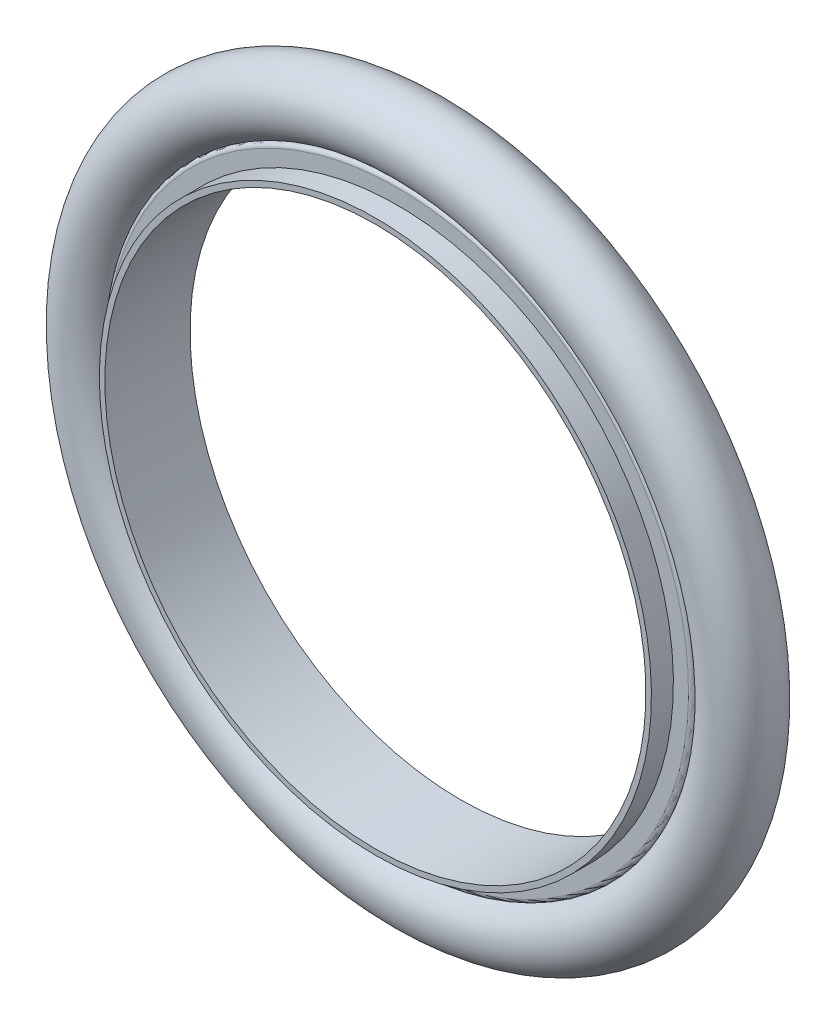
ISO-10303-21;
HEADER;
FILE_DESCRIPTION(('STEP AP214'),'2;1');
FILE_NAME('part.step','',(''),(''),'','','');
FILE_SCHEMA(('AUTOMOTIVE_DESIGN { 1 0 10303 214 1 1 1 1 }'));
ENDSEC;
DATA;
#1=APPLICATION_CONTEXT('core data for automotive mechanical design processes');
#2=APPLICATION_PROTOCOL_DEFINITION('international standard','automotive_design',2000,#1);
#3=PRODUCT_CONTEXT('',#1,'mechanical');
#4=PRODUCT('Part','Part','',(#3));
#5=PRODUCT_RELATED_PRODUCT_CATEGORY('part','',(#4));
#6=PRODUCT_DEFINITION_FORMATION('','',#4);
#7=PRODUCT_DEFINITION_CONTEXT('part definition',#1,'design');
#8=PRODUCT_DEFINITION('design','',#6,#7);
#9=PRODUCT_DEFINITION_SHAPE('','',#8);
#10=(LENGTH_UNIT() NAMED_UNIT(*) SI_UNIT(.MILLI.,.METRE.));
#11=(NAMED_UNIT(*) PLANE_ANGLE_UNIT() SI_UNIT($,.RADIAN.));
#12=(NAMED_UNIT(*) SI_UNIT($,.STERADIAN.) SOLID_ANGLE_UNIT());
#13=UNCERTAINTY_MEASURE_WITH_UNIT(LENGTH_MEASURE(1.E-05),#10,'distance_accuracy_value','');
#14=(GEOMETRIC_REPRESENTATION_CONTEXT(3) GLOBAL_UNCERTAINTY_ASSIGNED_CONTEXT((#13)) GLOBAL_UNIT_ASSIGNED_CONTEXT((#10,
#11,#12)) REPRESENTATION_CONTEXT('',''));
#15=CARTESIAN_POINT('',(0.,0.,0.));
#16=DIRECTION('',(0.,0.,1.));
#17=DIRECTION('',(1.,0.,0.));
#18=AXIS2_PLACEMENT_3D('',#15,#16,#17);
#19=CARTESIAN_POINT('',(0.,0.,0.));
#20=DIRECTION('',(0.,0.,1.));
#21=DIRECTION('',(0.,-1.,0.));
#22=AXIS2_PLACEMENT_3D('',#19,#20,#21);
#23=TOROIDAL_SURFACE('',#22,29.9873736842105,3.09612631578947);
#24=CARTESIAN_POINT('',(0.,-33.0835,0.));
#25=VERTEX_POINT('',#24);
#26=VERTEX_LOOP('',#25);
#27=FACE_BOUND('',#26,.T.);
#28=ADVANCED_FACE('F36',(#27),#23,.T.);
#29=CLOSED_SHELL('',(#28));
#30=MANIFOLD_SOLID_BREP('B2',#29);
#31=CARTESIAN_POINT('',(0.,0.,0.));
#32=DIRECTION('',(0.,0.,1.));
#33=DIRECTION('',(0.,-1.,0.));
#34=AXIS2_PLACEMENT_3D('',#31,#32,#33);
#35=TOROIDAL_SURFACE('',#34,29.9873736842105,3.09612631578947);
#36=CARTESIAN_POINT('',(0.,0.,1.52399999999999));
#37=DIRECTION('',(0.,0.,1.));
#38=DIRECTION('',(0.,-1.,0.));
#39=AXIS2_PLACEMENT_3D('',#36,#37,#38);
#40=CIRCLE('',#39,27.2923);
#41=CARTESIAN_POINT('',(0.,-27.2923,1.52399999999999));
#42=VERTEX_POINT('',#41);
#43=EDGE_CURVE('E35',#42,#42,#40,.T.);
#44=ORIENTED_EDGE('',*,*,#43,.F.);
#45=EDGE_LOOP('',(#44));
#46=FACE_BOUND('',#45,.T.);
#47=CARTESIAN_POINT('',(0.,0.,-1.524));
#48=DIRECTION('',(0.,0.,1.));
#49=DIRECTION('',(0.,-1.,0.));
#50=AXIS2_PLACEMENT_3D('',#47,#48,#49);
#51=CIRCLE('',#50,27.2923);
#52=CARTESIAN_POINT('',(0.,-27.2923,-1.52400000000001));
#53=VERTEX_POINT('',#52);
#54=EDGE_CURVE('E82',#53,#53,#51,.T.);
#55=ORIENTED_EDGE('',*,*,#54,.T.);
#56=EDGE_LOOP('',(#55));
#57=FACE_BOUND('',#56,.T.);
#58=ADVANCED_FACE('F48',(#46,#57),#35,.F.);
#59=CARTESIAN_POINT('',(0.,0.,1.52399999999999));
#60=DIRECTION('',(0.,0.,1.));
#61=DIRECTION('',(0.,-1.,0.));
#62=AXIS2_PLACEMENT_3D('',#59,#60,#61);
#63=TOROIDAL_SURFACE('',#62,26.9113,0.381000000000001);
#64=CARTESIAN_POINT('',(0.,0.,1.905));
#65=DIRECTION('',(0.,0.,1.));
#66=DIRECTION('',(0.,-1.,0.));
#67=AXIS2_PLACEMENT_3D('',#64,#65,#66);
#68=CIRCLE('',#67,26.9113);
#69=CARTESIAN_POINT('',(0.,-26.9113,1.90499999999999));
#70=VERTEX_POINT('',#69);
#71=EDGE_CURVE('E54',#70,#70,#68,.T.);
#72=ORIENTED_EDGE('',*,*,#71,.F.);
#73=EDGE_LOOP('',(#72));
#74=FACE_BOUND('',#73,.T.);
#75=ORIENTED_EDGE('',*,*,#43,.T.);
#76=EDGE_LOOP('',(#75));
#77=FACE_BOUND('',#76,.T.);
#78=ADVANCED_FACE('F131',(#74,#77),#63,.T.);
#79=CARTESIAN_POINT('',(0.,25.5143,1.905));
#80=DIRECTION('',(0.,0.,-1.));
#81=DIRECTION('',(0.,1.,0.));
#82=AXIS2_PLACEMENT_3D('',#79,#80,#81);
#83=PLANE('',#82);
#84=CARTESIAN_POINT('',(0.,0.,1.90499999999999));
#85=DIRECTION('',(0.,0.,1.));
#86=DIRECTION('',(0.,-1.,0.));
#87=AXIS2_PLACEMENT_3D('',#84,#85,#86);
#88=CIRCLE('',#87,25.5143);
#89=CARTESIAN_POINT('',(0.,-25.5143,1.90499999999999));
#90=VERTEX_POINT('',#89);
#91=EDGE_CURVE('E58',#90,#90,#88,.T.);
#92=ORIENTED_EDGE('',*,*,#91,.F.);
#93=EDGE_LOOP('',(#92));
#94=FACE_BOUND('',#93,.T.);
#95=ORIENTED_EDGE('',*,*,#71,.T.);
#96=EDGE_LOOP('',(#95));
#97=FACE_BOUND('',#96,.T.);
#98=ADVANCED_FACE('F126',(#94,#97),#83,.F.);
#99=CARTESIAN_POINT('',(0.,0.,3.937));
#100=DIRECTION('',(0.,0.,1.));
#101=DIRECTION('',(0.,-1.,0.));
#102=AXIS2_PLACEMENT_3D('',#99,#100,#101);
#103=CYLINDRICAL_SURFACE('',#102,25.5143);
#104=CARTESIAN_POINT('',(0.,0.,3.937));
#105=DIRECTION('',(0.,0.,1.));
#106=DIRECTION('',(0.,-1.,0.));
#107=AXIS2_PLACEMENT_3D('',#104,#105,#106);
#108=CIRCLE('',#107,25.5143);
#109=CARTESIAN_POINT('',(0.,-25.5143,3.937));
#110=VERTEX_POINT('',#109);
#111=EDGE_CURVE('E62',#110,#110,#108,.T.);
#112=ORIENTED_EDGE('',*,*,#111,.F.);
#113=EDGE_LOOP('',(#112));
#114=FACE_BOUND('',#113,.T.);
#115=ORIENTED_EDGE('',*,*,#91,.T.);
#116=EDGE_LOOP('',(#115));
#117=FACE_BOUND('',#116,.T.);
#118=ADVANCED_FACE('F120',(#114,#117),#103,.T.);
#119=CARTESIAN_POINT('',(0.,25.0063,3.93700000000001));
#120=DIRECTION('',(0.,0.,-1.));
#121=DIRECTION('',(0.,1.,0.));
#122=AXIS2_PLACEMENT_3D('',#119,#120,#121);
#123=PLANE('',#122);
#124=CARTESIAN_POINT('',(0.,0.,3.93700000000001));
#125=DIRECTION('',(0.,0.,1.));
#126=DIRECTION('',(0.,-1.,0.));
#127=AXIS2_PLACEMENT_3D('',#124,#125,#126);
#128=CIRCLE('',#127,25.0063);
#129=CARTESIAN_POINT('',(0.,-25.0063,3.937));
#130=VERTEX_POINT('',#129);
#131=EDGE_CURVE('E67',#130,#130,#128,.T.);
#132=ORIENTED_EDGE('',*,*,#131,.F.);
#133=EDGE_LOOP('',(#132));
#134=FACE_BOUND('',#133,.T.);
#135=ORIENTED_EDGE('',*,*,#111,.T.);
#136=EDGE_LOOP('',(#135));
#137=FACE_BOUND('',#136,.T.);
#138=ADVANCED_FACE('F114',(#134,#137),#123,.F.);
#139=CARTESIAN_POINT('',(0.,0.,3.937));
#140=DIRECTION('',(0.,0.,1.));
#141=DIRECTION('',(0.,-1.,0.));
#142=AXIS2_PLACEMENT_3D('',#139,#140,#141);
#143=CYLINDRICAL_SURFACE('',#142,25.0063);
#144=CARTESIAN_POINT('',(0.,0.,-3.93699999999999));
#145=DIRECTION('',(0.,0.,1.));
#146=DIRECTION('',(0.,-1.,0.));
#147=AXIS2_PLACEMENT_3D('',#144,#145,#146);
#148=CIRCLE('',#147,25.0063);
#149=CARTESIAN_POINT('',(0.,-25.0063,-3.937));
#150=VERTEX_POINT('',#149);
#151=EDGE_CURVE('E70',#150,#150,#148,.T.);
#152=ORIENTED_EDGE('',*,*,#151,.F.);
#153=EDGE_LOOP('',(#152));
#154=FACE_BOUND('',#153,.T.);
#155=ORIENTED_EDGE('',*,*,#131,.T.);
#156=EDGE_LOOP('',(#155));
#157=FACE_BOUND('',#156,.T.);
#158=ADVANCED_FACE('F108',(#154,#157),#143,.F.);
#159=CARTESIAN_POINT('',(0.,25.0063,-3.937));
#160=DIRECTION('',(0.,0.,1.));
#161=DIRECTION('',(0.,-1.,0.));
#162=AXIS2_PLACEMENT_3D('',#159,#160,#161);
#163=PLANE('',#162);
#164=CARTESIAN_POINT('',(0.,0.,-3.93700000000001));
#165=DIRECTION('',(0.,0.,1.));
#166=DIRECTION('',(0.,-1.,0.));
#167=AXIS2_PLACEMENT_3D('',#164,#165,#166);
#168=CIRCLE('',#167,25.5143);
#169=CARTESIAN_POINT('',(0.,-25.5143,-3.93700000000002));
#170=VERTEX_POINT('',#169);
#171=EDGE_CURVE('E73',#170,#170,#168,.T.);
#172=ORIENTED_EDGE('',*,*,#171,.F.);
#173=EDGE_LOOP('',(#172));
#174=FACE_BOUND('',#173,.T.);
#175=ORIENTED_EDGE('',*,*,#151,.T.);
#176=EDGE_LOOP('',(#175));
#177=FACE_BOUND('',#176,.T.);
#178=ADVANCED_FACE('F102',(#174,#177),#163,.F.);
#179=CARTESIAN_POINT('',(0.,0.,3.937));
#180=DIRECTION('',(0.,0.,1.));
#181=DIRECTION('',(0.,-1.,0.));
#182=AXIS2_PLACEMENT_3D('',#179,#180,#181);
#183=CYLINDRICAL_SURFACE('',#182,25.5143);
#184=CARTESIAN_POINT('',(0.,0.,-1.905));
#185=DIRECTION('',(0.,0.,1.));
#186=DIRECTION('',(0.,-1.,0.));
#187=AXIS2_PLACEMENT_3D('',#184,#185,#186);
#188=CIRCLE('',#187,25.5143);
#189=CARTESIAN_POINT('',(0.,-25.5143,-1.90500000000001));
#190=VERTEX_POINT('',#189);
#191=EDGE_CURVE('E76',#190,#190,#188,.T.);
#192=ORIENTED_EDGE('',*,*,#191,.F.);
#193=EDGE_LOOP('',(#192));
#194=FACE_BOUND('',#193,.T.);
#195=ORIENTED_EDGE('',*,*,#171,.T.);
#196=EDGE_LOOP('',(#195));
#197=FACE_BOUND('',#196,.T.);
#198=ADVANCED_FACE('F96',(#194,#197),#183,.T.);
#199=CARTESIAN_POINT('',(0.,25.5143,-1.905));
#200=DIRECTION('',(0.,0.,1.));
#201=DIRECTION('',(0.,-1.,0.));
#202=AXIS2_PLACEMENT_3D('',#199,#200,#201);
#203=PLANE('',#202);
#204=CARTESIAN_POINT('',(0.,0.,-1.905));
#205=DIRECTION('',(0.,0.,1.));
#206=DIRECTION('',(0.,-1.,0.));
#207=AXIS2_PLACEMENT_3D('',#204,#205,#206);
#208=CIRCLE('',#207,26.9113);
#209=CARTESIAN_POINT('',(0.,-26.9113,-1.90500000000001));
#210=VERTEX_POINT('',#209);
#211=EDGE_CURVE('E79',#210,#210,#208,.T.);
#212=ORIENTED_EDGE('',*,*,#211,.F.);
#213=EDGE_LOOP('',(#212));
#214=FACE_BOUND('',#213,.T.);
#215=ORIENTED_EDGE('',*,*,#191,.T.);
#216=EDGE_LOOP('',(#215));
#217=FACE_BOUND('',#216,.T.);
#218=ADVANCED_FACE('F90',(#214,#217),#203,.F.);
#219=CARTESIAN_POINT('',(0.,0.,-1.524));
#220=DIRECTION('',(0.,0.,1.));
#221=DIRECTION('',(0.,-1.,0.));
#222=AXIS2_PLACEMENT_3D('',#219,#220,#221);
#223=TOROIDAL_SURFACE('',#222,26.9113,0.381000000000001);
#224=ORIENTED_EDGE('',*,*,#54,.F.);
#225=EDGE_LOOP('',(#224));
#226=FACE_BOUND('',#225,.T.);
#227=ORIENTED_EDGE('',*,*,#211,.T.);
#228=EDGE_LOOP('',(#227));
#229=FACE_BOUND('',#228,.T.);
#230=ADVANCED_FACE('F87',(#226,#229),#223,.T.);
#231=CLOSED_SHELL('',(#58,#78,#98,#118,#138,#158,#178,#198,#218,#230));
#232=MANIFOLD_SOLID_BREP('B6',#231);
#233=ADVANCED_BREP_SHAPE_REPRESENTATION('',(#18,#30,#232),#14);
#234=SHAPE_DEFINITION_REPRESENTATION(#9,#233);
ENDSEC;
END-ISO-10303-21;
